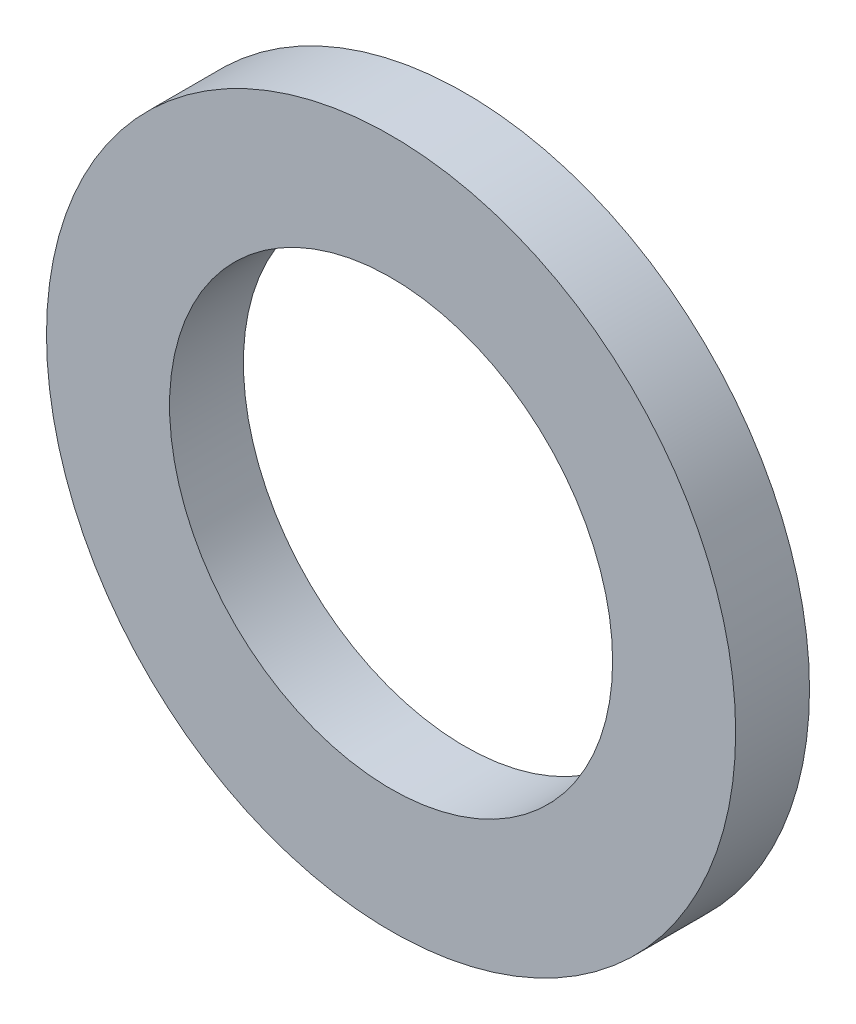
from build123d import *

# Parameters (mm, degrees)
ESQUISSE1_W = 2.5
ESQUISSE1_H = 1.5


with BuildPart() as part:
    # Esquisse1 → R_volution1 (revolve)
    with BuildSketch(Plane(origin=(0, 0, 0), x_dir=(1, 0, 0), z_dir=(0, 1, 0))):
        with Locations((5.75, -0.75)):
            Rectangle(ESQUISSE1_W, ESQUISSE1_H)
    revolve(axis=Axis((0, 0, 0), (0, 0, 1)))


solid = part.part
